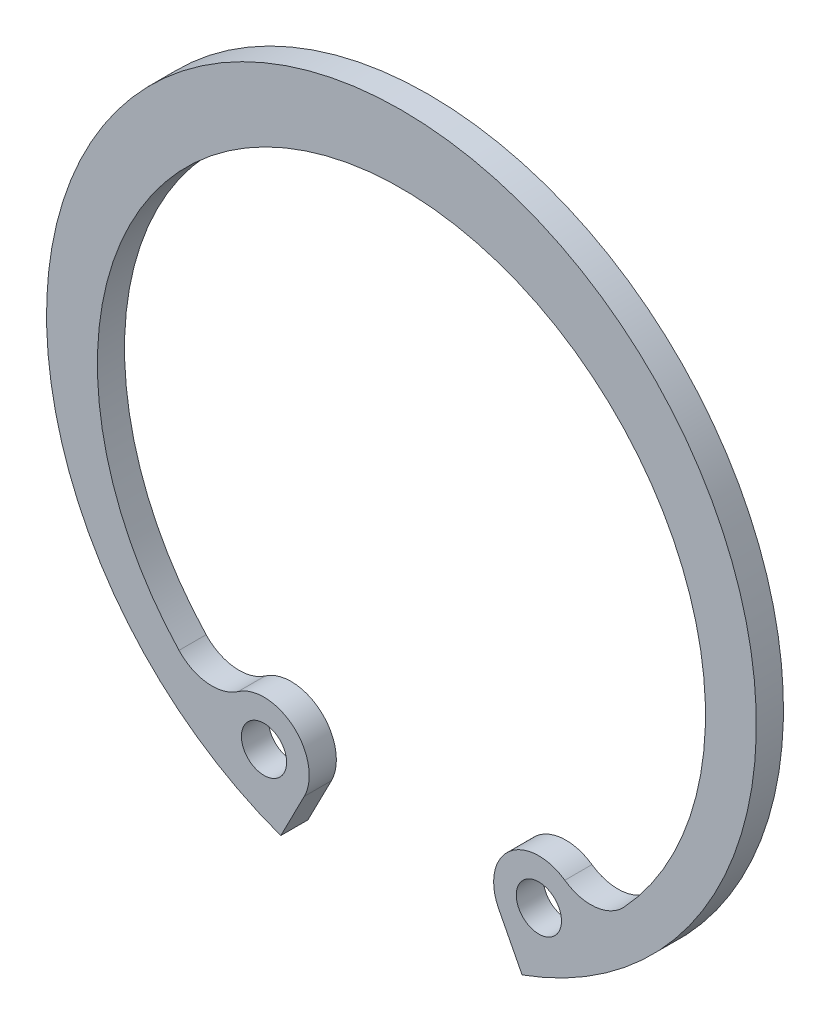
ISO-10303-21;
HEADER;
FILE_DESCRIPTION(('STEP AP214'),'2;1');
FILE_NAME('part.step','',(''),(''),'','','');
FILE_SCHEMA(('AUTOMOTIVE_DESIGN { 1 0 10303 214 1 1 1 1 }'));
ENDSEC;
DATA;
#1=APPLICATION_CONTEXT('core data for automotive mechanical design processes');
#2=APPLICATION_PROTOCOL_DEFINITION('international standard','automotive_design',2000,#1);
#3=PRODUCT_CONTEXT('',#1,'mechanical');
#4=PRODUCT('Part','Part','',(#3));
#5=PRODUCT_RELATED_PRODUCT_CATEGORY('part','',(#4));
#6=PRODUCT_DEFINITION_FORMATION('','',#4);
#7=PRODUCT_DEFINITION_CONTEXT('part definition',#1,'design');
#8=PRODUCT_DEFINITION('design','',#6,#7);
#9=PRODUCT_DEFINITION_SHAPE('','',#8);
#10=(LENGTH_UNIT() NAMED_UNIT(*) SI_UNIT(.MILLI.,.METRE.));
#11=(NAMED_UNIT(*) PLANE_ANGLE_UNIT() SI_UNIT($,.RADIAN.));
#12=(NAMED_UNIT(*) SI_UNIT($,.STERADIAN.) SOLID_ANGLE_UNIT());
#13=UNCERTAINTY_MEASURE_WITH_UNIT(LENGTH_MEASURE(1.E-05),#10,'distance_accuracy_value','');
#14=(GEOMETRIC_REPRESENTATION_CONTEXT(3) GLOBAL_UNCERTAINTY_ASSIGNED_CONTEXT((#13)) GLOBAL_UNIT_ASSIGNED_CONTEXT((#10,
#11,#12)) REPRESENTATION_CONTEXT('',''));
#15=CARTESIAN_POINT('',(0.,0.,0.));
#16=DIRECTION('',(0.,0.,1.));
#17=DIRECTION('',(1.,0.,0.));
#18=AXIS2_PLACEMENT_3D('',#15,#16,#17);
#19=CARTESIAN_POINT('',(-0.0501907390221,-14.9907800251,0.));
#20=DIRECTION('',(0.,0.,1.));
#21=DIRECTION('',(1.,0.,0.));
#22=AXIS2_PLACEMENT_3D('',#19,#20,#21);
#23=PLANE('',#22);
#24=CARTESIAN_POINT('',(6.07849104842,-26.8297061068,0.));
#25=DIRECTION('',(0.,0.,1.));
#26=DIRECTION('',(1.,0.,0.));
#27=AXIS2_PLACEMENT_3D('',#24,#25,#26);
#28=CIRCLE('',#27,1.);
#29=CARTESIAN_POINT('',(7.07849104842,-26.8297061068,0.));
#30=VERTEX_POINT('',#29);
#31=EDGE_CURVE('E128',#30,#30,#28,.T.);
#32=ORIENTED_EDGE('',*,*,#31,.T.);
#33=EDGE_LOOP('',(#32));
#34=FACE_BOUND('',#33,.T.);
#35=CARTESIAN_POINT('',(-6.07849104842,-26.8297061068,0.));
#36=DIRECTION('',(0.,0.,1.));
#37=DIRECTION('',(1.,0.,0.));
#38=AXIS2_PLACEMENT_3D('',#35,#36,#37);
#39=CIRCLE('',#38,1.);
#40=CARTESIAN_POINT('',(-5.07849104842,-26.8297061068,0.));
#41=VERTEX_POINT('',#40);
#42=EDGE_CURVE('E131',#41,#41,#39,.T.);
#43=ORIENTED_EDGE('',*,*,#42,.T.);
#44=EDGE_LOOP('',(#43));
#45=FACE_BOUND('',#44,.T.);
#46=CARTESIAN_POINT('',(-6.07849104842,-26.8297061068,0.));
#47=DIRECTION('',(0.,0.,1.));
#48=DIRECTION('',(1.,0.,0.));
#49=AXIS2_PLACEMENT_3D('',#46,#47,#48);
#50=CIRCLE('',#49,2.);
#51=CARTESIAN_POINT('',(-4.29958787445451,-27.7437649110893,0.));
#52=VERTEX_POINT('',#51);
#53=CARTESIAN_POINT('',(-7.22763784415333,-25.1927999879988,0.));
#54=VERTEX_POINT('',#53);
#55=EDGE_CURVE('E21',#52,#54,#50,.T.);
#56=ORIENTED_EDGE('',*,*,#55,.F.);
#57=DIRECTION('',(0.457029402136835,0.889451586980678,0.));
#58=VECTOR('',#57,1.);
#59=CARTESIAN_POINT('',(-4.29958787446,-27.7437649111,0.));
#60=LINE('',#59,#58);
#61=CARTESIAN_POINT('',(-5.33799999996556,-29.7646793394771,0.));
#62=VERTEX_POINT('',#61);
#63=EDGE_CURVE('E105',#62,#52,#60,.T.);
#64=ORIENTED_EDGE('',*,*,#63,.F.);
#65=CARTESIAN_POINT('',(0.,-15.,0.));
#66=DIRECTION('',(0.,0.,1.));
#67=DIRECTION('',(1.,0.,0.));
#68=AXIS2_PLACEMENT_3D('',#65,#66,#67);
#69=CIRCLE('',#68,15.7);
#70=CARTESIAN_POINT('',(5.33799999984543,-29.7646793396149,0.));
#71=VERTEX_POINT('',#70);
#72=EDGE_CURVE('E107',#71,#62,#69,.T.);
#73=ORIENTED_EDGE('',*,*,#72,.F.);
#74=DIRECTION('',(0.457029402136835,-0.889451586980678,0.));
#75=VECTOR('',#74,1.);
#76=CARTESIAN_POINT('',(5.338,-29.7646793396,0.));
#77=LINE('',#76,#75);
#78=CARTESIAN_POINT('',(4.29958787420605,-27.7437649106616,0.));
#79=VERTEX_POINT('',#78);
#80=EDGE_CURVE('E108',#79,#71,#77,.T.);
#81=ORIENTED_EDGE('',*,*,#80,.F.);
#82=CARTESIAN_POINT('',(6.07849104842,-26.8297061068,0.));
#83=DIRECTION('',(0.,0.,1.));
#84=DIRECTION('',(1.,0.,0.));
#85=AXIS2_PLACEMENT_3D('',#82,#83,#84);
#86=CIRCLE('',#85,2.);
#87=CARTESIAN_POINT('',(7.22763784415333,-25.1927999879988,0.));
#88=VERTEX_POINT('',#87);
#89=EDGE_CURVE('E111',#88,#79,#86,.T.);
#90=ORIENTED_EDGE('',*,*,#89,.F.);
#91=CARTESIAN_POINT('',(8.37678463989,-23.5558938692,0.));
#92=DIRECTION('',(0.,0.,1.));
#93=DIRECTION('',(1.,0.,0.));
#94=AXIS2_PLACEMENT_3D('',#91,#92,#93);
#95=CIRCLE('',#94,2.);
#96=CARTESIAN_POINT('',(9.83997846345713,-24.9193687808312,0.));
#97=VERTEX_POINT('',#96);
#98=EDGE_CURVE('E141',#88,#97,#95,.T.);
#99=ORIENTED_EDGE('',*,*,#98,.T.);
#100=CARTESIAN_POINT('',(0.,-15.75,0.));
#101=DIRECTION('',(0.,0.,1.));
#102=DIRECTION('',(1.,0.,0.));
#103=AXIS2_PLACEMENT_3D('',#100,#101,#102);
#104=CIRCLE('',#103,13.45);
#105=CARTESIAN_POINT('',(-9.83997846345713,-24.9193687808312,0.));
#106=VERTEX_POINT('',#105);
#107=EDGE_CURVE('E94',#97,#106,#104,.T.);
#108=ORIENTED_EDGE('',*,*,#107,.T.);
#109=CARTESIAN_POINT('',(-8.37678463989,-23.5558938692,0.));
#110=DIRECTION('',(0.,0.,1.));
#111=DIRECTION('',(1.,0.,0.));
#112=AXIS2_PLACEMENT_3D('',#109,#110,#111);
#113=CIRCLE('',#112,2.);
#114=EDGE_CURVE('E92',#106,#54,#113,.T.);
#115=ORIENTED_EDGE('',*,*,#114,.T.);
#116=EDGE_LOOP('',(#56,#64,#73,#81,#90,#99,#108,#115));
#117=FACE_BOUND('',#116,.T.);
#118=ADVANCED_FACE('F17',(#34,#45,#117),#23,.F.);
#119=CARTESIAN_POINT('',(-6.07849104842,-26.8297061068,0.));
#120=DIRECTION('',(0.,0.,1.));
#121=DIRECTION('',(1.,0.,0.));
#122=AXIS2_PLACEMENT_3D('',#119,#120,#121);
#123=CYLINDRICAL_SURFACE('',#122,2.);
#124=DIRECTION('',(0.,0.,1.));
#125=VECTOR('',#124,1.);
#126=CARTESIAN_POINT('',(-7.22763784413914,-25.1927999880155,0.));
#127=LINE('',#126,#125);
#128=CARTESIAN_POINT('',(-7.22763784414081,-25.1927999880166,1.19999999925));
#129=VERTEX_POINT('',#128);
#130=EDGE_CURVE('E85',#54,#129,#127,.T.);
#131=ORIENTED_EDGE('',*,*,#130,.T.);
#132=CARTESIAN_POINT('',(-6.07849104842,-26.8297061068,1.19999999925));
#133=DIRECTION('',(0.,0.,1.));
#134=DIRECTION('',(1.,0.,0.));
#135=AXIS2_PLACEMENT_3D('',#132,#133,#134);
#136=CIRCLE('',#135,2.);
#137=CARTESIAN_POINT('',(-4.29958787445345,-27.7437649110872,1.199999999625));
#138=VERTEX_POINT('',#137);
#139=EDGE_CURVE('E126',#138,#129,#136,.T.);
#140=ORIENTED_EDGE('',*,*,#139,.F.);
#141=DIRECTION('',(0.,0.,1.));
#142=VECTOR('',#141,1.);
#143=CARTESIAN_POINT('',(-4.29958787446,-27.7437649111,0.));
#144=LINE('',#143,#142);
#145=EDGE_CURVE('E88',#52,#138,#144,.T.);
#146=ORIENTED_EDGE('',*,*,#145,.F.);
#147=ORIENTED_EDGE('',*,*,#55,.T.);
#148=EDGE_LOOP('',(#131,#140,#146,#147));
#149=FACE_BOUND('',#148,.T.);
#150=ADVANCED_FACE('F83',(#149),#123,.T.);
#151=CARTESIAN_POINT('',(-8.37678463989,-23.5558938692,0.));
#152=DIRECTION('',(0.,0.,1.));
#153=DIRECTION('',(1.,0.,0.));
#154=AXIS2_PLACEMENT_3D('',#151,#152,#153);
#155=CYLINDRICAL_SURFACE('',#154,2.);
#156=DIRECTION('',(0.,0.,1.));
#157=VECTOR('',#156,1.);
#158=CARTESIAN_POINT('',(-9.83997846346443,-24.9193687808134,0.));
#159=LINE('',#158,#157);
#160=CARTESIAN_POINT('',(-9.83997846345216,-24.9193687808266,1.19999999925));
#161=VERTEX_POINT('',#160);
#162=EDGE_CURVE('E97',#106,#161,#159,.T.);
#163=ORIENTED_EDGE('',*,*,#162,.T.);
#164=CARTESIAN_POINT('',(-8.37678463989,-23.5558938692,1.19999999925));
#165=DIRECTION('',(0.,0.,1.));
#166=DIRECTION('',(1.,0.,0.));
#167=AXIS2_PLACEMENT_3D('',#164,#165,#166);
#168=CIRCLE('',#167,2.);
#169=EDGE_CURVE('E100',#129,#161,#168,.F.);
#170=ORIENTED_EDGE('',*,*,#169,.F.);
#171=ORIENTED_EDGE('',*,*,#130,.F.);
#172=ORIENTED_EDGE('',*,*,#114,.F.);
#173=EDGE_LOOP('',(#163,#170,#171,#172));
#174=FACE_BOUND('',#173,.T.);
#175=ADVANCED_FACE('F98',(#174),#155,.F.);
#176=CARTESIAN_POINT('',(0.,-15.75,0.));
#177=DIRECTION('',(0.,0.,1.));
#178=DIRECTION('',(1.,0.,0.));
#179=AXIS2_PLACEMENT_3D('',#176,#177,#178);
#180=CYLINDRICAL_SURFACE('',#179,13.45);
#181=ORIENTED_EDGE('',*,*,#107,.F.);
#182=DIRECTION('',(0.,0.,1.));
#183=VECTOR('',#182,1.);
#184=CARTESIAN_POINT('',(9.83997846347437,-24.9193687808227,0.));
#185=LINE('',#184,#183);
#186=CARTESIAN_POINT('',(9.8399784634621,-24.9193687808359,1.19999999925));
#187=VERTEX_POINT('',#186);
#188=EDGE_CURVE('E143',#97,#187,#185,.T.);
#189=ORIENTED_EDGE('',*,*,#188,.T.);
#190=CARTESIAN_POINT('',(0.,-15.75,1.19999999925));
#191=DIRECTION('',(0.,0.,1.));
#192=DIRECTION('',(1.,0.,0.));
#193=AXIS2_PLACEMENT_3D('',#190,#191,#192);
#194=CIRCLE('',#193,13.45);
#195=EDGE_CURVE('E123',#161,#187,#194,.F.);
#196=ORIENTED_EDGE('',*,*,#195,.F.);
#197=ORIENTED_EDGE('',*,*,#162,.F.);
#198=EDGE_LOOP('',(#181,#189,#196,#197));
#199=FACE_BOUND('',#198,.T.);
#200=ADVANCED_FACE('F147',(#199),#180,.F.);
#201=CARTESIAN_POINT('',(8.37678463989,-23.5558938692,0.));
#202=DIRECTION('',(0.,0.,1.));
#203=DIRECTION('',(1.,0.,0.));
#204=AXIS2_PLACEMENT_3D('',#201,#202,#203);
#205=CYLINDRICAL_SURFACE('',#204,2.);
#206=DIRECTION('',(0.,0.,1.));
#207=VECTOR('',#206,1.);
#208=CARTESIAN_POINT('',(7.22763784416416,-25.1927999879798,0.));
#209=LINE('',#208,#207);
#210=CARTESIAN_POINT('',(7.22763784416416,-25.1927999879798,1.199999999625));
#211=VERTEX_POINT('',#210);
#212=EDGE_CURVE('E140',#211,#88,#209,.F.);
#213=ORIENTED_EDGE('',*,*,#212,.F.);
#214=CARTESIAN_POINT('',(8.37678463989,-23.5558938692,1.19999999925));
#215=DIRECTION('',(0.,0.,1.));
#216=DIRECTION('',(1.,0.,0.));
#217=AXIS2_PLACEMENT_3D('',#214,#215,#216);
#218=CIRCLE('',#217,2.);
#219=EDGE_CURVE('E120',#187,#211,#218,.F.);
#220=ORIENTED_EDGE('',*,*,#219,.F.);
#221=ORIENTED_EDGE('',*,*,#188,.F.);
#222=ORIENTED_EDGE('',*,*,#98,.F.);
#223=EDGE_LOOP('',(#213,#220,#221,#222));
#224=FACE_BOUND('',#223,.T.);
#225=ADVANCED_FACE('F169',(#224),#205,.F.);
#226=CARTESIAN_POINT('',(6.07849104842,-26.8297061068,0.));
#227=DIRECTION('',(0.,0.,1.));
#228=DIRECTION('',(1.,0.,0.));
#229=AXIS2_PLACEMENT_3D('',#226,#227,#228);
#230=CYLINDRICAL_SURFACE('',#229,2.);
#231=DIRECTION('',(0.,0.,1.));
#232=VECTOR('',#231,1.);
#233=CARTESIAN_POINT('',(4.2995878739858,-27.743764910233,0.));
#234=LINE('',#233,#232);
#235=CARTESIAN_POINT('',(4.29958787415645,-27.7437649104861,1.2));
#236=VERTEX_POINT('',#235);
#237=EDGE_CURVE('E110',#236,#79,#234,.F.);
#238=ORIENTED_EDGE('',*,*,#237,.F.);
#239=CARTESIAN_POINT('',(6.07849104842,-26.8297061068,1.2));
#240=DIRECTION('',(0.,0.,1.));
#241=DIRECTION('',(1.,0.,0.));
#242=AXIS2_PLACEMENT_3D('',#239,#240,#241);
#243=CIRCLE('',#242,2.);
#244=EDGE_CURVE('E118',#211,#236,#243,.T.);
#245=ORIENTED_EDGE('',*,*,#244,.F.);
#246=ORIENTED_EDGE('',*,*,#212,.T.);
#247=ORIENTED_EDGE('',*,*,#89,.T.);
#248=EDGE_LOOP('',(#238,#245,#246,#247));
#249=FACE_BOUND('',#248,.T.);
#250=ADVANCED_FACE('F166',(#249),#230,.T.);
#251=CARTESIAN_POINT('',(5.338,-29.7646793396,0.));
#252=DIRECTION('',(-0.889451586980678,-0.457029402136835,0.));
#253=DIRECTION('',(0.457029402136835,-0.889451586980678,0.));
#254=AXIS2_PLACEMENT_3D('',#251,#252,#253);
#255=PLANE('',#254);
#256=DIRECTION('',(0.457029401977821,-0.889451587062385,0.));
#257=VECTOR('',#256,1.);
#258=CARTESIAN_POINT('',(4.29958787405,-27.7437649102,1.2));
#259=LINE('',#258,#257);
#260=CARTESIAN_POINT('',(5.33799999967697,-29.7646793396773,1.199999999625));
#261=VERTEX_POINT('',#260);
#262=EDGE_CURVE('E117',#236,#261,#259,.T.);
#263=ORIENTED_EDGE('',*,*,#262,.F.);
#264=ORIENTED_EDGE('',*,*,#237,.T.);
#265=ORIENTED_EDGE('',*,*,#80,.T.);
#266=DIRECTION('',(0.,0.,1.));
#267=VECTOR('',#266,1.);
#268=CARTESIAN_POINT('',(5.33799999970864,-29.7646793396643,0.));
#269=LINE('',#268,#267);
#270=EDGE_CURVE('E137',#261,#71,#269,.F.);
#271=ORIENTED_EDGE('',*,*,#270,.F.);
#272=EDGE_LOOP('',(#263,#264,#265,#271));
#273=FACE_BOUND('',#272,.T.);
#274=ADVANCED_FACE('F172',(#273),#255,.T.);
#275=CARTESIAN_POINT('',(0.,-15.,0.));
#276=DIRECTION('',(0.,0.,1.));
#277=DIRECTION('',(1.,0.,0.));
#278=AXIS2_PLACEMENT_3D('',#275,#276,#277);
#279=CYLINDRICAL_SURFACE('',#278,15.7);
#280=DIRECTION('',(0.,0.,1.));
#281=VECTOR('',#280,1.);
#282=CARTESIAN_POINT('',(-5.33799999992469,-29.7646793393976,0.));
#283=LINE('',#282,#281);
#284=CARTESIAN_POINT('',(-5.33799999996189,-29.7646793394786,1.199999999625));
#285=VERTEX_POINT('',#284);
#286=EDGE_CURVE('E134',#285,#62,#283,.F.);
#287=ORIENTED_EDGE('',*,*,#286,.F.);
#288=CARTESIAN_POINT('',(0.,-15.,1.19999999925));
#289=DIRECTION('',(0.,0.,1.));
#290=DIRECTION('',(1.,0.,0.));
#291=AXIS2_PLACEMENT_3D('',#288,#289,#290);
#292=CIRCLE('',#291,15.7);
#293=EDGE_CURVE('E36',#261,#285,#292,.T.);
#294=ORIENTED_EDGE('',*,*,#293,.F.);
#295=ORIENTED_EDGE('',*,*,#270,.T.);
#296=ORIENTED_EDGE('',*,*,#72,.T.);
#297=EDGE_LOOP('',(#287,#294,#295,#296));
#298=FACE_BOUND('',#297,.T.);
#299=ADVANCED_FACE('F174',(#298),#279,.T.);
#300=CARTESIAN_POINT('',(-4.29958787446,-27.7437649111,0.));
#301=DIRECTION('',(0.889451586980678,-0.457029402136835,0.));
#302=DIRECTION('',(0.457029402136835,0.889451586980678,0.));
#303=AXIS2_PLACEMENT_3D('',#300,#301,#302);
#304=PLANE('',#303);
#305=DIRECTION('',(0.45702940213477,0.88945158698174,0.));
#306=VECTOR('',#305,1.);
#307=CARTESIAN_POINT('',(-5.33799999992,-29.7646793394,1.2));
#308=LINE('',#307,#306);
#309=EDGE_CURVE('E115',#285,#138,#308,.T.);
#310=ORIENTED_EDGE('',*,*,#309,.F.);
#311=ORIENTED_EDGE('',*,*,#286,.T.);
#312=ORIENTED_EDGE('',*,*,#63,.T.);
#313=ORIENTED_EDGE('',*,*,#145,.T.);
#314=EDGE_LOOP('',(#310,#311,#312,#313));
#315=FACE_BOUND('',#314,.T.);
#316=ADVANCED_FACE('F152',(#315),#304,.T.);
#317=CARTESIAN_POINT('',(-6.07849104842,-26.8297061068,0.));
#318=DIRECTION('',(0.,0.,1.));
#319=DIRECTION('',(1.,0.,0.));
#320=AXIS2_PLACEMENT_3D('',#317,#318,#319);
#321=CYLINDRICAL_SURFACE('',#320,1.);
#322=ORIENTED_EDGE('',*,*,#42,.F.);
#323=EDGE_LOOP('',(#322));
#324=FACE_BOUND('',#323,.T.);
#325=CARTESIAN_POINT('',(-6.07849104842,-26.8297061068,1.2));
#326=DIRECTION('',(0.,0.,1.));
#327=DIRECTION('',(1.,0.,0.));
#328=AXIS2_PLACEMENT_3D('',#325,#326,#327);
#329=CIRCLE('',#328,1.);
#330=CARTESIAN_POINT('',(-5.07849104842,-26.8297061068,1.2));
#331=VERTEX_POINT('',#330);
#332=EDGE_CURVE('E27',#331,#331,#329,.F.);
#333=ORIENTED_EDGE('',*,*,#332,.F.);
#334=EDGE_LOOP('',(#333));
#335=FACE_BOUND('',#334,.T.);
#336=ADVANCED_FACE('F183',(#324,#335),#321,.F.);
#337=CARTESIAN_POINT('',(6.07849104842,-26.8297061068,0.));
#338=DIRECTION('',(0.,0.,1.));
#339=DIRECTION('',(1.,0.,0.));
#340=AXIS2_PLACEMENT_3D('',#337,#338,#339);
#341=CYLINDRICAL_SURFACE('',#340,1.);
#342=ORIENTED_EDGE('',*,*,#31,.F.);
#343=EDGE_LOOP('',(#342));
#344=FACE_BOUND('',#343,.T.);
#345=CARTESIAN_POINT('',(6.07849104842,-26.8297061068,1.2));
#346=DIRECTION('',(0.,0.,1.));
#347=DIRECTION('',(1.,0.,0.));
#348=AXIS2_PLACEMENT_3D('',#345,#346,#347);
#349=CIRCLE('',#348,1.);
#350=CARTESIAN_POINT('',(7.07849104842,-26.8297061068,1.2));
#351=VERTEX_POINT('',#350);
#352=EDGE_CURVE('E11',#351,#351,#349,.F.);
#353=ORIENTED_EDGE('',*,*,#352,.F.);
#354=EDGE_LOOP('',(#353));
#355=FACE_BOUND('',#354,.T.);
#356=ADVANCED_FACE('F187',(#344,#355),#341,.F.);
#357=CARTESIAN_POINT('',(-0.0501907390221,-14.9907800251,1.2));
#358=DIRECTION('',(0.,0.,1.));
#359=DIRECTION('',(1.,0.,0.));
#360=AXIS2_PLACEMENT_3D('',#357,#358,#359);
#361=PLANE('',#360);
#362=ORIENTED_EDGE('',*,*,#352,.T.);
#363=EDGE_LOOP('',(#362));
#364=FACE_BOUND('',#363,.T.);
#365=ORIENTED_EDGE('',*,*,#332,.T.);
#366=EDGE_LOOP('',(#365));
#367=FACE_BOUND('',#366,.T.);
#368=ORIENTED_EDGE('',*,*,#293,.T.);
#369=ORIENTED_EDGE('',*,*,#309,.T.);
#370=ORIENTED_EDGE('',*,*,#139,.T.);
#371=ORIENTED_EDGE('',*,*,#169,.T.);
#372=ORIENTED_EDGE('',*,*,#195,.T.);
#373=ORIENTED_EDGE('',*,*,#219,.T.);
#374=ORIENTED_EDGE('',*,*,#244,.T.);
#375=ORIENTED_EDGE('',*,*,#262,.T.);
#376=EDGE_LOOP('',(#368,#369,#370,#371,#372,#373,#374,#375));
#377=FACE_BOUND('',#376,.T.);
#378=ADVANCED_FACE('F19',(#364,#367,#377),#361,.T.);
#379=CLOSED_SHELL('',(#118,#150,#175,#200,#225,#250,#274,#299,#316,#336,#356,#378));
#380=MANIFOLD_SOLID_BREP('B1',#379);
#381=ADVANCED_BREP_SHAPE_REPRESENTATION('',(#18,#380),#14);
#382=SHAPE_DEFINITION_REPRESENTATION(#9,#381);
ENDSEC;
END-ISO-10303-21;
